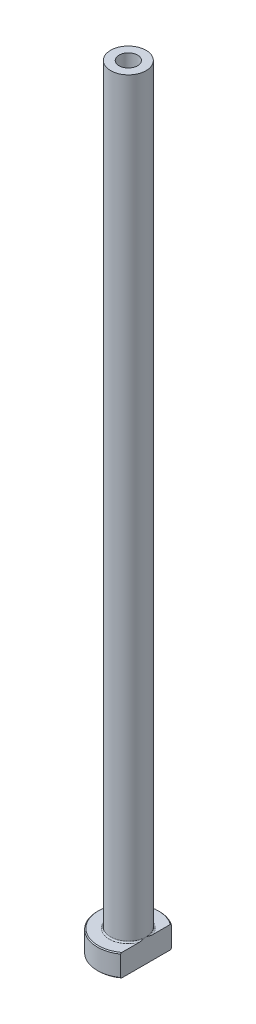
ISO-10303-21;
HEADER;
FILE_DESCRIPTION(('STEP AP214'),'2;1');
FILE_NAME('part.step','',(''),(''),'','','');
FILE_SCHEMA(('AUTOMOTIVE_DESIGN { 1 0 10303 214 1 1 1 1 }'));
ENDSEC;
DATA;
#1=APPLICATION_CONTEXT('core data for automotive mechanical design processes');
#2=APPLICATION_PROTOCOL_DEFINITION('international standard','automotive_design',2000,#1);
#3=PRODUCT_CONTEXT('',#1,'mechanical');
#4=PRODUCT('Part','Part','',(#3));
#5=PRODUCT_RELATED_PRODUCT_CATEGORY('part','',(#4));
#6=PRODUCT_DEFINITION_FORMATION('','',#4);
#7=PRODUCT_DEFINITION_CONTEXT('part definition',#1,'design');
#8=PRODUCT_DEFINITION('design','',#6,#7);
#9=PRODUCT_DEFINITION_SHAPE('','',#8);
#10=(LENGTH_UNIT() NAMED_UNIT(*) SI_UNIT(.MILLI.,.METRE.));
#11=(NAMED_UNIT(*) PLANE_ANGLE_UNIT() SI_UNIT($,.RADIAN.));
#12=(NAMED_UNIT(*) SI_UNIT($,.STERADIAN.) SOLID_ANGLE_UNIT());
#13=UNCERTAINTY_MEASURE_WITH_UNIT(LENGTH_MEASURE(1.E-05),#10,'distance_accuracy_value','');
#14=(GEOMETRIC_REPRESENTATION_CONTEXT(3) GLOBAL_UNCERTAINTY_ASSIGNED_CONTEXT((#13)) GLOBAL_UNIT_ASSIGNED_CONTEXT((#10,
#11,#12)) REPRESENTATION_CONTEXT('',''));
#15=CARTESIAN_POINT('',(0.,0.,0.));
#16=DIRECTION('',(0.,0.,1.));
#17=DIRECTION('',(1.,0.,0.));
#18=AXIS2_PLACEMENT_3D('',#15,#16,#17);
#19=CARTESIAN_POINT('',(0.,92.1876809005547,0.));
#20=DIRECTION('',(0.,1.,0.));
#21=DIRECTION('',(0.,0.,1.));
#22=AXIS2_PLACEMENT_3D('',#19,#20,#21);
#23=CYLINDRICAL_SURFACE('',#22,2.1);
#24=CARTESIAN_POINT('',(0.,175.,0.));
#25=DIRECTION('',(0.,1.,0.));
#26=DIRECTION('',(0.,0.,1.));
#27=AXIS2_PLACEMENT_3D('',#24,#25,#26);
#28=CIRCLE('',#27,2.1);
#29=CARTESIAN_POINT('',(0.,175.,2.1));
#30=VERTEX_POINT('',#29);
#31=EDGE_CURVE('E167',#30,#30,#28,.T.);
#32=ORIENTED_EDGE('',*,*,#31,.T.);
#33=EDGE_LOOP('',(#32));
#34=FACE_BOUND('',#33,.T.);
#35=CARTESIAN_POINT('',(0.,130.,0.));
#36=DIRECTION('',(0.,1.,0.));
#37=DIRECTION('',(0.,0.,1.));
#38=AXIS2_PLACEMENT_3D('',#35,#36,#37);
#39=CIRCLE('',#38,2.1);
#40=CARTESIAN_POINT('',(0.,130.,2.1));
#41=VERTEX_POINT('',#40);
#42=EDGE_CURVE('E170',#41,#41,#39,.T.);
#43=ORIENTED_EDGE('',*,*,#42,.F.);
#44=EDGE_LOOP('',(#43));
#45=FACE_BOUND('',#44,.T.);
#46=ADVANCED_FACE('F32',(#34,#45),#23,.F.);
#47=CARTESIAN_POINT('',(-2.1,175.,0.));
#48=DIRECTION('',(0.,1.,0.));
#49=DIRECTION('',(0.,0.,1.));
#50=AXIS2_PLACEMENT_3D('',#47,#48,#49);
#51=PLANE('',#50);
#52=CARTESIAN_POINT('',(0.,175.,0.));
#53=DIRECTION('',(0.,1.,0.));
#54=DIRECTION('',(0.,0.,1.));
#55=AXIS2_PLACEMENT_3D('',#52,#53,#54);
#56=CIRCLE('',#55,4.00000000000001);
#57=CARTESIAN_POINT('',(0.,175.,4.00000000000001));
#58=VERTEX_POINT('',#57);
#59=EDGE_CURVE('E174',#58,#58,#56,.T.);
#60=ORIENTED_EDGE('',*,*,#59,.T.);
#61=EDGE_LOOP('',(#60));
#62=FACE_BOUND('',#61,.T.);
#63=ORIENTED_EDGE('',*,*,#31,.F.);
#64=EDGE_LOOP('',(#63));
#65=FACE_BOUND('',#64,.T.);
#66=ADVANCED_FACE('F157',(#62,#65),#51,.T.);
#67=CARTESIAN_POINT('',(0.,92.1876809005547,0.));
#68=DIRECTION('',(0.,1.,0.));
#69=DIRECTION('',(0.,0.,1.));
#70=AXIS2_PLACEMENT_3D('',#67,#68,#69);
#71=CYLINDRICAL_SURFACE('',#70,4.);
#72=CARTESIAN_POINT('',(0.,5.3,0.));
#73=DIRECTION('',(0.,1.,0.));
#74=DIRECTION('',(0.,0.,1.));
#75=AXIS2_PLACEMENT_3D('',#72,#73,#74);
#76=CIRCLE('',#75,4.);
#77=CARTESIAN_POINT('',(4.,5.3,0.));
#78=VERTEX_POINT('',#77);
#79=EDGE_CURVE('E180',#78,#78,#76,.T.);
#80=ORIENTED_EDGE('',*,*,#79,.T.);
#81=EDGE_LOOP('',(#80));
#82=FACE_BOUND('',#81,.T.);
#83=ORIENTED_EDGE('',*,*,#59,.F.);
#84=EDGE_LOOP('',(#83));
#85=FACE_BOUND('',#84,.T.);
#86=ADVANCED_FACE('F162',(#82,#85),#71,.T.);
#87=CARTESIAN_POINT('',(-3.99999999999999,5.,0.));
#88=DIRECTION('',(0.,1.,0.));
#89=DIRECTION('',(0.,0.,1.));
#90=AXIS2_PLACEMENT_3D('',#87,#88,#89);
#91=PLANE('',#90);
#92=DIRECTION('',(0.,0.,1.));
#93=VECTOR('',#92,1.);
#94=CARTESIAN_POINT('',(4.,5.,0.));
#95=LINE('',#94,#93);
#96=CARTESIAN_POINT('',(4.,5.,-5.499090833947));
#97=VERTEX_POINT('',#96);
#98=CARTESIAN_POINT('',(4.,5.,-1.57797338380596));
#99=VERTEX_POINT('',#98);
#100=EDGE_CURVE('E54',#97,#99,#95,.T.);
#101=ORIENTED_EDGE('',*,*,#100,.F.);
#102=CARTESIAN_POINT('',(0.,5.,0.));
#103=DIRECTION('',(0.,1.,0.));
#104=DIRECTION('',(0.,0.,1.));
#105=AXIS2_PLACEMENT_3D('',#102,#103,#104);
#106=CIRCLE('',#105,6.79999999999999);
#107=CARTESIAN_POINT('',(3.99999999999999,5.,5.499090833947));
#108=VERTEX_POINT('',#107);
#109=EDGE_CURVE('E186',#97,#108,#106,.T.);
#110=ORIENTED_EDGE('',*,*,#109,.T.);
#111=CARTESIAN_POINT('',(4.,5.,1.57797338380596));
#112=VERTEX_POINT('',#111);
#113=EDGE_CURVE('E134',#112,#108,#95,.T.);
#114=ORIENTED_EDGE('',*,*,#113,.F.);
#115=CARTESIAN_POINT('',(0.,5.,0.));
#116=DIRECTION('',(0.,1.,0.));
#117=DIRECTION('',(0.,0.,1.));
#118=AXIS2_PLACEMENT_3D('',#115,#116,#117);
#119=CIRCLE('',#118,4.3);
#120=EDGE_CURVE('E183',#112,#99,#119,.F.);
#121=ORIENTED_EDGE('',*,*,#120,.T.);
#122=EDGE_LOOP('',(#101,#110,#114,#121));
#123=FACE_BOUND('',#122,.T.);
#124=ADVANCED_FACE('F197',(#123),#91,.T.);
#125=CARTESIAN_POINT('',(0.,92.1876809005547,0.));
#126=DIRECTION('',(0.,1.,0.));
#127=DIRECTION('',(0.,0.,1.));
#128=AXIS2_PLACEMENT_3D('',#125,#126,#127);
#129=CYLINDRICAL_SURFACE('',#128,6.99999999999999);
#130=DIRECTION('',(0.,-1.,0.));
#131=VECTOR('',#130,1.);
#132=CARTESIAN_POINT('',(3.99999999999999,175.,5.74456264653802));
#133=LINE('',#132,#131);
#134=CARTESIAN_POINT('',(3.99999999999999,4.79999999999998,5.74456264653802));
#135=VERTEX_POINT('',#134);
#136=CARTESIAN_POINT('',(3.99999999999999,0.20000000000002,5.74456264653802));
#137=VERTEX_POINT('',#136);
#138=EDGE_CURVE('E82',#135,#137,#133,.T.);
#139=ORIENTED_EDGE('',*,*,#138,.F.);
#140=CARTESIAN_POINT('',(0.,4.79999999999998,0.));
#141=DIRECTION('',(0.,1.,0.));
#142=DIRECTION('',(0.,0.,1.));
#143=AXIS2_PLACEMENT_3D('',#140,#141,#142);
#144=CIRCLE('',#143,6.99999999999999);
#145=CARTESIAN_POINT('',(4.,4.79999999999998,-5.74456264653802));
#146=VERTEX_POINT('',#145);
#147=EDGE_CURVE('E95',#135,#146,#144,.F.);
#148=ORIENTED_EDGE('',*,*,#147,.T.);
#149=DIRECTION('',(0.,-1.,0.));
#150=VECTOR('',#149,1.);
#151=CARTESIAN_POINT('',(4.,175.,-5.74456264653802));
#152=LINE('',#151,#150);
#153=CARTESIAN_POINT('',(4.,0.200000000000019,-5.74456264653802));
#154=VERTEX_POINT('',#153);
#155=EDGE_CURVE('E192',#146,#154,#152,.T.);
#156=ORIENTED_EDGE('',*,*,#155,.T.);
#157=CARTESIAN_POINT('',(0.,0.20000000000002,0.));
#158=DIRECTION('',(0.,-1.,0.));
#159=DIRECTION('',(0.,0.,-1.));
#160=AXIS2_PLACEMENT_3D('',#157,#158,#159);
#161=CIRCLE('',#160,6.99999999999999);
#162=EDGE_CURVE('E98',#154,#137,#161,.F.);
#163=ORIENTED_EDGE('',*,*,#162,.T.);
#164=EDGE_LOOP('',(#139,#148,#156,#163));
#165=FACE_BOUND('',#164,.T.);
#166=ADVANCED_FACE('F190',(#165),#129,.T.);
#167=CARTESIAN_POINT('',(-6.99999999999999,0.,0.));
#168=DIRECTION('',(0.,-1.,0.));
#169=DIRECTION('',(0.,0.,-1.));
#170=AXIS2_PLACEMENT_3D('',#167,#168,#169);
#171=PLANE('',#170);
#172=CARTESIAN_POINT('',(0.,0.,0.));
#173=DIRECTION('',(0.,-1.,0.));
#174=DIRECTION('',(0.,0.,-1.));
#175=AXIS2_PLACEMENT_3D('',#172,#173,#174);
#176=CIRCLE('',#175,2.84999999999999);
#177=CARTESIAN_POINT('',(0.,0.,-2.84999999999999));
#178=VERTEX_POINT('',#177);
#179=EDGE_CURVE('E40',#178,#178,#176,.F.);
#180=ORIENTED_EDGE('',*,*,#179,.T.);
#181=EDGE_LOOP('',(#180));
#182=FACE_BOUND('',#181,.T.);
#183=DIRECTION('',(0.,0.,-1.));
#184=VECTOR('',#183,1.);
#185=CARTESIAN_POINT('',(3.99999999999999,0.,5.74456264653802));
#186=LINE('',#185,#184);
#187=CARTESIAN_POINT('',(3.99999999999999,0.,5.49909083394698));
#188=VERTEX_POINT('',#187);
#189=CARTESIAN_POINT('',(4.,0.,-5.49909083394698));
#190=VERTEX_POINT('',#189);
#191=EDGE_CURVE('E47',#188,#190,#186,.T.);
#192=ORIENTED_EDGE('',*,*,#191,.F.);
#193=CARTESIAN_POINT('',(0.,0.,0.));
#194=DIRECTION('',(0.,-1.,0.));
#195=DIRECTION('',(0.,0.,-1.));
#196=AXIS2_PLACEMENT_3D('',#193,#194,#195);
#197=CIRCLE('',#196,6.79999999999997);
#198=EDGE_CURVE('E92',#188,#190,#197,.T.);
#199=ORIENTED_EDGE('',*,*,#198,.T.);
#200=EDGE_LOOP('',(#192,#199));
#201=FACE_BOUND('',#200,.T.);
#202=ADVANCED_FACE('F91',(#182,#201),#171,.T.);
#203=CARTESIAN_POINT('',(0.,92.1876809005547,0.));
#204=DIRECTION('',(0.,1.,0.));
#205=DIRECTION('',(0.,0.,1.));
#206=AXIS2_PLACEMENT_3D('',#203,#204,#205);
#207=CYLINDRICAL_SURFACE('',#206,2.35);
#208=CARTESIAN_POINT('',(0.,0.499999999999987,0.));
#209=DIRECTION('',(0.,-1.,0.));
#210=DIRECTION('',(0.,0.,-1.));
#211=AXIS2_PLACEMENT_3D('',#208,#209,#210);
#212=CIRCLE('',#211,2.35);
#213=CARTESIAN_POINT('',(0.,0.499999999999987,-2.35));
#214=VERTEX_POINT('',#213);
#215=EDGE_CURVE('E11',#214,#214,#212,.T.);
#216=ORIENTED_EDGE('',*,*,#215,.T.);
#217=EDGE_LOOP('',(#216));
#218=FACE_BOUND('',#217,.T.);
#219=CARTESIAN_POINT('',(0.,118.,0.));
#220=DIRECTION('',(0.,1.,0.));
#221=DIRECTION('',(0.,0.,1.));
#222=AXIS2_PLACEMENT_3D('',#219,#220,#221);
#223=CIRCLE('',#222,2.35000000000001);
#224=CARTESIAN_POINT('',(0.,118.,2.35000000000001));
#225=VERTEX_POINT('',#224);
#226=EDGE_CURVE('E172',#225,#225,#223,.T.);
#227=ORIENTED_EDGE('',*,*,#226,.T.);
#228=EDGE_LOOP('',(#227));
#229=FACE_BOUND('',#228,.T.);
#230=ADVANCED_FACE('F215',(#218,#229),#207,.F.);
#231=CARTESIAN_POINT('',(0.,118.,0.));
#232=DIRECTION('',(0.,-1.,0.));
#233=DIRECTION('',(0.,0.,-1.));
#234=AXIS2_PLACEMENT_3D('',#231,#232,#233);
#235=CONICAL_SURFACE('',#234,2.35000000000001,0.0208303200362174);
#236=ORIENTED_EDGE('',*,*,#42,.T.);
#237=EDGE_LOOP('',(#236));
#238=FACE_BOUND('',#237,.T.);
#239=ORIENTED_EDGE('',*,*,#226,.F.);
#240=EDGE_LOOP('',(#239));
#241=FACE_BOUND('',#240,.T.);
#242=ADVANCED_FACE('F111',(#238,#241),#235,.F.);
#243=CARTESIAN_POINT('',(0.,5.3,0.));
#244=DIRECTION('',(0.,1.,0.));
#245=DIRECTION('',(0.,0.,1.));
#246=AXIS2_PLACEMENT_3D('',#243,#244,#245);
#247=TOROIDAL_SURFACE('',#246,4.3,0.3);
#248=ORIENTED_EDGE('',*,*,#120,.F.);
#249=CARTESIAN_POINT('',(4.,5.3,0.));
#250=CARTESIAN_POINT('',(4.,5.30000062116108,-1.06261529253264E-10));
#251=CARTESIAN_POINT('',(4.,5.30000124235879,2.17726073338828E-07));
#252=CARTESIAN_POINT('',(4.,5.30000240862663,8.36141018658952E-07));
#253=CARTESIAN_POINT('',(4.,5.30000294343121,1.2501168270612E-06));
#254=CARTESIAN_POINT('',(4.,5.30000404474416,2.23959340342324E-06));
#255=CARTESIAN_POINT('',(4.,5.30000459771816,2.83084465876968E-06));
#256=CARTESIAN_POINT('',(4.,5.30000559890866,4.0651660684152E-06));
#257=CARTESIAN_POINT('',(4.,5.30000604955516,4.70640086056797E-06));
#258=CARTESIAN_POINT('',(4.,5.3000076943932,7.15677214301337E-06));
#259=CARTESIAN_POINT('',(4.,5.3000087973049,9.02995984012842E-06));
#260=CARTESIAN_POINT('',(4.,5.30001063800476,1.27664888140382E-05));
#261=CARTESIAN_POINT('',(4.,5.30001139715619,1.46197807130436E-05));
#262=CARTESIAN_POINT('',(4.,5.30001453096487,2.23679224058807E-05));
#263=CARTESIAN_POINT('',(4.,5.30001683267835,2.82968752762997E-05));
#264=CARTESIAN_POINT('',(4.,5.30002027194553,3.95668733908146E-05));
#265=CARTESIAN_POINT('',(4.,5.30002152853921,4.48715464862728E-05));
#266=CARTESIAN_POINT('',(4.,5.30003060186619,8.40118205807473E-05));
#267=CARTESIAN_POINT('',(4.,5.30003739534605,0.000118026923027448));
#268=CARTESIAN_POINT('',(4.,5.30006713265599,0.00025221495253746));
#269=CARTESIAN_POINT('',(4.,5.30009559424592,0.00035113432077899));
#270=CARTESIAN_POINT('',(3.99999999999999,5.30020622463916,0.000742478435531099));
#271=CARTESIAN_POINT('',(4.,5.30028475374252,0.00103561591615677));
#272=CARTESIAN_POINT('',(4.,5.30059889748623,0.00219920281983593));
#273=CARTESIAN_POINT('',(4.,5.3008390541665,0.00306873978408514));
#274=CARTESIAN_POINT('',(3.99999999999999,5.30183682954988,0.00669141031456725));
#275=CARTESIAN_POINT('',(4.,5.30258877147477,0.00944568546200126));
#276=CARTESIAN_POINT('',(4.,5.31066890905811,0.0390293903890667));
#277=CARTESIAN_POINT('',(4.,5.31802631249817,0.0658531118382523));
#278=CARTESIAN_POINT('',(3.99999999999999,5.3323967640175,0.118441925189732));
#279=CARTESIAN_POINT('',(4.,5.33941183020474,0.144206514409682));
#280=CARTESIAN_POINT('',(4.,5.35427366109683,0.199017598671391));
#281=CARTESIAN_POINT('',(4.,5.36211313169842,0.228066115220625));
#282=CARTESIAN_POINT('',(4.,5.3777634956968,0.28651184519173));
#283=CARTESIAN_POINT('',(4.,5.38557313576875,0.315909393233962));
#284=CARTESIAN_POINT('',(4.,5.40425662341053,0.386994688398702));
#285=CARTESIAN_POINT('',(4.,5.41505237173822,0.428703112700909));
#286=CARTESIAN_POINT('',(4.,5.43592310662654,0.511098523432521));
#287=CARTESIAN_POINT('',(4.,5.44600969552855,0.551782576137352));
#288=CARTESIAN_POINT('',(4.,5.47850986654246,0.686599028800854));
#289=CARTESIAN_POINT('',(4.,5.4997837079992,0.781011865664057));
#290=CARTESIAN_POINT('',(4.,5.53807543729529,0.971847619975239));
#291=CARTESIAN_POINT('',(4.,5.5550427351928,1.06828120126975));
#292=CARTESIAN_POINT('',(4.,5.5758240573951,1.21752725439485));
#293=CARTESIAN_POINT('',(4.,5.5820979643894,1.26999379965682));
#294=CARTESIAN_POINT('',(4.,5.59210686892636,1.37516324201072));
#295=CARTESIAN_POINT('',(4.,5.59584265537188,1.42786606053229));
#296=CARTESIAN_POINT('',(4.,5.60010438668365,1.53310673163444));
#297=CARTESIAN_POINT('',(4.,5.6006487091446,1.58564378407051));
#298=CARTESIAN_POINT('',(4.,5.59767158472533,1.69058605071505));
#299=CARTESIAN_POINT('',(4.,5.59415502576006,1.74299134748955));
#300=CARTESIAN_POINT('',(4.,5.58503062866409,1.81903290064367));
#301=CARTESIAN_POINT('',(4.,5.58157617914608,1.84292934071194));
#302=CARTESIAN_POINT('',(4.,5.57329952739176,1.89051061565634));
#303=CARTESIAN_POINT('',(4.,5.56847619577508,1.91419525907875));
#304=CARTESIAN_POINT('',(4.,5.5572664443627,1.96092888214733));
#305=CARTESIAN_POINT('',(4.,5.55089740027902,1.98398195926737));
#306=CARTESIAN_POINT('',(4.,5.53623434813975,2.02945550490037));
#307=CARTESIAN_POINT('',(4.,5.52794253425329,2.05187666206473));
#308=CARTESIAN_POINT('',(4.,5.50887098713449,2.09590631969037));
#309=CARTESIAN_POINT('',(4.,5.49806837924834,2.1175050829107));
#310=CARTESIAN_POINT('',(4.,5.4733340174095,2.15885583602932));
#311=CARTESIAN_POINT('',(4.,5.45941272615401,2.17861369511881));
#312=CARTESIAN_POINT('',(4.,5.43588221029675,2.20522942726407));
#313=CARTESIAN_POINT('',(4.,5.42781139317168,2.21344043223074));
#314=CARTESIAN_POINT('',(4.,5.4106511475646,2.22875149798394));
#315=CARTESIAN_POINT('',(4.,5.40156129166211,2.23585108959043));
#316=CARTESIAN_POINT('',(4.,5.38220524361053,2.24859694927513));
#317=CARTESIAN_POINT('',(4.,5.37192420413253,2.25422119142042));
#318=CARTESIAN_POINT('',(4.,5.35045072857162,2.26331064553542));
#319=CARTESIAN_POINT('',(4.,5.3392612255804,2.26678251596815));
#320=CARTESIAN_POINT('',(4.,5.31952044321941,2.27051268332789));
#321=CARTESIAN_POINT('',(4.,5.31108453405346,2.27139016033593));
#322=CARTESIAN_POINT('',(4.,5.29418624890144,2.27168963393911));
#323=CARTESIAN_POINT('',(4.,5.28572387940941,2.27111196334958));
#324=CARTESIAN_POINT('',(4.,5.26904138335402,2.26855580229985));
#325=CARTESIAN_POINT('',(4.,5.2608206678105,2.26658107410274));
#326=CARTESIAN_POINT('',(4.,5.2447821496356,2.26139496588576));
#327=CARTESIAN_POINT('',(4.,5.2369646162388,2.25818277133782));
#328=CARTESIAN_POINT('',(4.,5.21851235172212,2.24908332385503));
#329=CARTESIAN_POINT('',(4.,5.20815219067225,2.24264095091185));
#330=CARTESIAN_POINT('',(4.,5.1885797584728,2.22819957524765));
#331=CARTESIAN_POINT('',(4.,5.17937061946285,2.22019647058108));
#332=CARTESIAN_POINT('',(4.,5.1566538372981,2.19777756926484));
#333=CARTESIAN_POINT('',(4.,5.14403484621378,2.18246908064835));
#334=CARTESIAN_POINT('',(4.,5.12118369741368,2.15020843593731));
#335=CARTESIAN_POINT('',(4.,5.1109548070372,2.13325407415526));
#336=CARTESIAN_POINT('',(4.,5.09273574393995,2.09892324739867));
#337=CARTESIAN_POINT('',(4.,5.08468212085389,2.08157988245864));
#338=CARTESIAN_POINT('',(4.,5.07005901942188,2.04627072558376));
#339=CARTESIAN_POINT('',(4.,5.06349101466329,2.02830433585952));
#340=CARTESIAN_POINT('',(4.,5.04555485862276,1.97350761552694));
#341=CARTESIAN_POINT('',(4.,5.03608974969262,1.93605770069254));
#342=CARTESIAN_POINT('',(4.,5.01780569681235,1.84529235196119));
#343=CARTESIAN_POINT('',(4.,5.01077018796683,1.79164082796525));
#344=CARTESIAN_POINT('',(4.,5.00182846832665,1.68379947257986));
#345=CARTESIAN_POINT('',(4.,4.99993887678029,1.62960846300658));
#346=CARTESIAN_POINT('',(4.,5.0000612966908,1.52361204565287));
#347=CARTESIAN_POINT('',(4.,5.00190698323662,1.47180551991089));
#348=CARTESIAN_POINT('',(4.,5.00841243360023,1.36835357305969));
#349=CARTESIAN_POINT('',(4.,5.01307376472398,1.31670825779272));
#350=CARTESIAN_POINT('',(4.,5.02905484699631,1.17431887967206));
#351=CARTESIAN_POINT('',(4.,5.04274090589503,1.08384207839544));
#352=CARTESIAN_POINT('',(4.,5.06701714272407,0.947757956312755));
#353=CARTESIAN_POINT('',(4.,5.07585573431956,0.901814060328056));
#354=CARTESIAN_POINT('',(4.,5.09458665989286,0.810008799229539));
#355=CARTESIAN_POINT('',(4.,5.10448180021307,0.764148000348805));
#356=CARTESIAN_POINT('',(4.,5.12892434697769,0.655631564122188));
#357=CARTESIAN_POINT('',(3.99999999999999,5.14383556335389,0.593058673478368));
#358=CARTESIAN_POINT('',(4.,5.17458762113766,0.468885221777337));
#359=CARTESIAN_POINT('',(4.,5.19041623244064,0.407281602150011));
#360=CARTESIAN_POINT('',(3.99999999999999,5.22090834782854,0.291232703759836));
#361=CARTESIAN_POINT('',(3.99999999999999,5.23550024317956,0.2367683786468));
#362=CARTESIAN_POINT('',(4.00000000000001,5.26562550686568,0.125604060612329));
#363=CARTESIAN_POINT('',(4.00000000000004,5.28117250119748,0.0689076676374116));
#364=CARTESIAN_POINT('',(3.99999999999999,5.29741226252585,0.00944154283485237));
#365=CARTESIAN_POINT('',(3.99999999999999,5.29816540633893,0.00668315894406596));
#366=CARTESIAN_POINT('',(4.,5.29916346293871,0.00305954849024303));
#367=CARTESIAN_POINT('',(4.,5.29940273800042,0.00219318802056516));
#368=CARTESIAN_POINT('',(3.99999999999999,5.29971580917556,0.00103357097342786));
#369=CARTESIAN_POINT('',(3.99999999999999,5.29979412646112,0.000741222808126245));
#370=CARTESIAN_POINT('',(4.,5.29990450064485,0.00035080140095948));
#371=CARTESIAN_POINT('',(4.,5.29993292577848,0.000252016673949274));
#372=CARTESIAN_POINT('',(3.99999999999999,5.29996263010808,0.000117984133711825));
#373=CARTESIAN_POINT('',(3.99999999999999,5.29996941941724,8.39881898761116E-05));
#374=CARTESIAN_POINT('',(4.,5.29997848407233,4.48674015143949E-05));
#375=CARTESIAN_POINT('',(4.,5.29997973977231,3.95638189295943E-05));
#376=CARTESIAN_POINT('',(4.,5.29998317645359,2.8296033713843E-05));
#377=CARTESIAN_POINT('',(4.,5.29998547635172,2.23681454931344E-05));
#378=CARTESIAN_POINT('',(4.,5.29998860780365,1.46211000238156E-05));
#379=CARTESIAN_POINT('',(4.,5.29998936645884,1.2767889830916E-05));
#380=CARTESIAN_POINT('',(4.,5.29999120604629,9.03144036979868E-06));
#381=CARTESIAN_POINT('',(4.,5.29999230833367,7.15824074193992E-06));
#382=CARTESIAN_POINT('',(4.,5.29999395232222,4.70775514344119E-06));
#383=CARTESIAN_POINT('',(4.,5.29999440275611,4.06646377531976E-06));
#384=CARTESIAN_POINT('',(4.,5.29999540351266,2.83199084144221E-06));
#385=CARTESIAN_POINT('',(4.,5.29999595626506,2.24064341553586E-06));
#386=CARTESIAN_POINT('',(4.,5.2999970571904,1.25093972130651E-06));
#387=CARTESIAN_POINT('',(4.,5.29999759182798,8.36841075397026E-07));
#388=CARTESIAN_POINT('',(4.,5.29999875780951,2.18117755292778E-07));
#389=CARTESIAN_POINT('',(4.,5.29999937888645,1.06254606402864E-10));
#390=CARTESIAN_POINT('',(4.,5.3,0.));
#391=B_SPLINE_CURVE_WITH_KNOTS('',3,(#249,#250,#251,#252,#253,#254,#255,#256,#257,#258,#259,
#260,#261,#262,#263,#264,#265,#266,#267,#268,#269,#270,#271,#272,#273,#274,#275,#276,#277,#278,
#279,#280,#281,#282,#283,#284,#285,#286,#287,#288,#289,#290,#291,#292,#293,#294,#295,#296,#297,
#298,#299,#300,#301,#302,#303,#304,#305,#306,#307,#308,#309,#310,#311,#312,#313,#314,#315,#316,
#317,#318,#319,#320,#321,#322,#323,#324,#325,#326,#327,#328,#329,#330,#331,#332,#333,#334,#335,
#336,#337,#338,#339,#340,#341,#342,#343,#344,#345,#346,#347,#348,#349,#350,#351,#352,#353,#354,
#355,#356,#357,#358,#359,#360,#361,#362,#363,#364,#365,#366,#367,#368,#369,#370,#371,#372,#373,
#374,#375,#376,#377,#378,#379,#380,#381,#382,#383,#384,#385,#386,#387,#388,#389,#390),
.UNSPECIFIED.,.T.,.F.,(4,2,2,2,2,2,2,2,2,2,2,2,2,2,2,2,2,2,2,2,2,2,2,2,2,2,2,2,2,2,2,2,2,2,2,2,
2,2,2,2,2,2,2,2,2,2,2,2,2,2,2,2,2,2,2,2,2,2,2,2,2,2,2,2,2,2,2,2,2,2,4),(0.,1.87484430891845E-06,
3.90180055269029E-06,6.31683886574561E-06,8.66652039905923E-06,1.51627563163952E-05,
2.1165794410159E-05,4.020907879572E-05,5.65429486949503E-05,0.000160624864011,
0.000469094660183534,0.00137985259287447,0.00408571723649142,0.0126514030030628,
0.0960918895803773,0.176200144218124,0.266463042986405,0.357714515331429,0.486961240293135,
0.61270708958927,0.902988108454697,1.196535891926,1.35501075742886,1.51343634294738,
1.67094875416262,1.82827177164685,1.90067591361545,1.97313996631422,2.04482437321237,
2.11642737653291,2.18871023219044,2.26075412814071,2.29521947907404,2.32969934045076,
2.36466792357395,2.39952778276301,2.42485422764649,2.45017488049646,2.47542760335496,
2.50069697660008,2.53708899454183,2.57357798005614,2.63276032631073,2.69202310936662,
2.74930315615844,2.80663977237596,2.92223125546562,3.08420752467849,3.24670629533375,
3.40212850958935,3.55763731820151,3.83192962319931,3.97228382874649,4.11302057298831,
4.30598130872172,4.49678885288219,4.66594443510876,4.84230602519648,4.85088453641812,
4.85358051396,4.8544888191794,4.85479687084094,4.8549008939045,4.8549172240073,4.85493626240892,
4.85494226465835,4.85494875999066,4.85495110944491,4.85495352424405,4.85495555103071,
4.85495742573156),.UNSPECIFIED.);
#392=EDGE_CURVE('E126',#112,#78,#391,.T.);
#393=ORIENTED_EDGE('',*,*,#392,.T.);
#394=ORIENTED_EDGE('',*,*,#79,.F.);
#395=CARTESIAN_POINT('',(4.,5.3,0.));
#396=CARTESIAN_POINT('',(4.,5.29999937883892,1.06262853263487E-10));
#397=CARTESIAN_POINT('',(4.,5.29999875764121,-2.17726072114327E-07));
#398=CARTESIAN_POINT('',(4.,5.29999759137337,-8.36141017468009E-07));
#399=CARTESIAN_POINT('',(4.,5.29999705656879,-1.25011682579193E-06));
#400=CARTESIAN_POINT('',(4.,5.29999595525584,-2.23959340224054E-06));
#401=CARTESIAN_POINT('',(4.,5.29999540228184,-2.83084465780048E-06));
#402=CARTESIAN_POINT('',(4.,5.29999440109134,-4.06516606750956E-06));
#403=CARTESIAN_POINT('',(4.,5.29999395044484,-4.70640085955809E-06));
#404=CARTESIAN_POINT('',(4.,5.2999923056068,-7.15677214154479E-06));
#405=CARTESIAN_POINT('',(4.,5.2999912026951,-9.02995983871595E-06));
#406=CARTESIAN_POINT('',(4.,5.29998936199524,-1.27664888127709E-05));
#407=CARTESIAN_POINT('',(4.,5.29998860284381,-1.46197807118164E-05));
#408=CARTESIAN_POINT('',(4.,5.29998546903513,-2.2367922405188E-05));
#409=CARTESIAN_POINT('',(4.,5.29998316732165,-2.82968752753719E-05));
#410=CARTESIAN_POINT('',(4.,5.29997972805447,-3.95668733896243E-05));
#411=CARTESIAN_POINT('',(4.,5.29997847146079,-4.48715464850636E-05));
#412=CARTESIAN_POINT('',(4.,5.29996939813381,-8.40118205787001E-05));
#413=CARTESIAN_POINT('',(4.,5.29996260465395,-0.000118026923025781));
#414=CARTESIAN_POINT('',(4.,5.29993286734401,-0.000252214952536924));
#415=CARTESIAN_POINT('',(4.,5.29990440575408,-0.000351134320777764));
#416=CARTESIAN_POINT('',(3.99999999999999,5.29979377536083,-0.000742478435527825));
#417=CARTESIAN_POINT('',(4.,5.29971524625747,-0.00103561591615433));
#418=CARTESIAN_POINT('',(4.,5.29940110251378,-0.00219920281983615));
#419=CARTESIAN_POINT('',(4.,5.2991609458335,-0.00306873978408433));
#420=CARTESIAN_POINT('',(3.99999999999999,5.29816317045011,-0.00669141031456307));
#421=CARTESIAN_POINT('',(4.,5.29741122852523,-0.00944568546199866));
#422=CARTESIAN_POINT('',(4.,5.28933109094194,-0.0390293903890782));
#423=CARTESIAN_POINT('',(4.,5.28197368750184,-0.0658531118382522));
#424=CARTESIAN_POINT('',(3.99999999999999,5.26760323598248,-0.118441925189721));
#425=CARTESIAN_POINT('',(4.,5.26058816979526,-0.144206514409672));
#426=CARTESIAN_POINT('',(4.,5.24572633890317,-0.199017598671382));
#427=CARTESIAN_POINT('',(4.,5.23788686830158,-0.228066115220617));
#428=CARTESIAN_POINT('',(4.,5.2222365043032,-0.286511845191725));
#429=CARTESIAN_POINT('',(4.,5.21442686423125,-0.315909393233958));
#430=CARTESIAN_POINT('',(4.,5.19574337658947,-0.386994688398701));
#431=CARTESIAN_POINT('',(4.,5.18494762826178,-0.428703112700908));
#432=CARTESIAN_POINT('',(4.,5.16407689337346,-0.511098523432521));
#433=CARTESIAN_POINT('',(4.,5.15399030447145,-0.551782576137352));
#434=CARTESIAN_POINT('',(4.,5.12149013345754,-0.686599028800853));
#435=CARTESIAN_POINT('',(4.,5.1002162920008,-0.781011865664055));
#436=CARTESIAN_POINT('',(4.,5.06192456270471,-0.971847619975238));
#437=CARTESIAN_POINT('',(4.,5.0449572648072,-1.06828120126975));
#438=CARTESIAN_POINT('',(4.,5.02417594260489,-1.21752725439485));
#439=CARTESIAN_POINT('',(4.,5.01790203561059,-1.26999379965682));
#440=CARTESIAN_POINT('',(4.,5.00789313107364,-1.37516324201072));
#441=CARTESIAN_POINT('',(4.,5.00415734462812,-1.42786606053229));
#442=CARTESIAN_POINT('',(4.,4.99989561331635,-1.53310673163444));
#443=CARTESIAN_POINT('',(4.,4.9993512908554,-1.58564378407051));
#444=CARTESIAN_POINT('',(4.,5.00232841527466,-1.69058605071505));
#445=CARTESIAN_POINT('',(4.,5.00584497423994,-1.74299134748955));
#446=CARTESIAN_POINT('',(4.,5.0149693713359,-1.81903290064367));
#447=CARTESIAN_POINT('',(4.,5.01842382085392,-1.84292934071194));
#448=CARTESIAN_POINT('',(4.,5.02670047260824,-1.89051061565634));
#449=CARTESIAN_POINT('',(4.,5.03152380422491,-1.91419525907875));
#450=CARTESIAN_POINT('',(4.,5.0427335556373,-1.96092888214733));
#451=CARTESIAN_POINT('',(4.,5.04910259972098,-1.98398195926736));
#452=CARTESIAN_POINT('',(4.,5.06376565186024,-2.02945550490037));
#453=CARTESIAN_POINT('',(4.,5.07205746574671,-2.05187666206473));
#454=CARTESIAN_POINT('',(4.,5.09112901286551,-2.09590631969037));
#455=CARTESIAN_POINT('',(4.,5.10193162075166,-2.1175050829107));
#456=CARTESIAN_POINT('',(4.,5.1266659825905,-2.15885583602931));
#457=CARTESIAN_POINT('',(4.,5.14058727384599,-2.17861369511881));
#458=CARTESIAN_POINT('',(4.,5.16411778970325,-2.20522942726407));
#459=CARTESIAN_POINT('',(4.,5.17218860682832,-2.21344043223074));
#460=CARTESIAN_POINT('',(4.,5.1893488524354,-2.22875149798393));
#461=CARTESIAN_POINT('',(4.,5.19843870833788,-2.23585108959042));
#462=CARTESIAN_POINT('',(4.,5.21779475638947,-2.24859694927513));
#463=CARTESIAN_POINT('',(4.,5.22807579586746,-2.25422119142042));
#464=CARTESIAN_POINT('',(4.,5.24954927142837,-2.26331064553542));
#465=CARTESIAN_POINT('',(4.,5.2607387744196,-2.26678251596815));
#466=CARTESIAN_POINT('',(4.,5.28047955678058,-2.27051268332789));
#467=CARTESIAN_POINT('',(4.,5.28891546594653,-2.27139016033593));
#468=CARTESIAN_POINT('',(4.,5.30581375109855,-2.27168963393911));
#469=CARTESIAN_POINT('',(4.,5.31427612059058,-2.27111196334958));
#470=CARTESIAN_POINT('',(4.,5.33095861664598,-2.26855580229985));
#471=CARTESIAN_POINT('',(4.,5.3391793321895,-2.26658107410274));
#472=CARTESIAN_POINT('',(4.,5.35521785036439,-2.26139496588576));
#473=CARTESIAN_POINT('',(4.,5.3630353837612,-2.25818277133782));
#474=CARTESIAN_POINT('',(4.,5.38148764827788,-2.24908332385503));
#475=CARTESIAN_POINT('',(4.,5.39184780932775,-2.24264095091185));
#476=CARTESIAN_POINT('',(4.,5.4114202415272,-2.22819957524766));
#477=CARTESIAN_POINT('',(4.,5.42062938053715,-2.22019647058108));
#478=CARTESIAN_POINT('',(4.,5.44334616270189,-2.19777756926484));
#479=CARTESIAN_POINT('',(4.,5.45596515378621,-2.18246908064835));
#480=CARTESIAN_POINT('',(4.,5.47881630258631,-2.15020843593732));
#481=CARTESIAN_POINT('',(4.,5.48904519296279,-2.13325407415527));
#482=CARTESIAN_POINT('',(4.,5.50726425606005,-2.09892324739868));
#483=CARTESIAN_POINT('',(4.,5.51531787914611,-2.08157988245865));
#484=CARTESIAN_POINT('',(4.,5.52994098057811,-2.04627072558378));
#485=CARTESIAN_POINT('',(4.,5.5365089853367,-2.02830433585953));
#486=CARTESIAN_POINT('',(4.,5.55444514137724,-1.97350761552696));
#487=CARTESIAN_POINT('',(4.,5.56391025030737,-1.93605770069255));
#488=CARTESIAN_POINT('',(4.,5.58219430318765,-1.84529235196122));
#489=CARTESIAN_POINT('',(4.,5.58922981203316,-1.79164082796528));
#490=CARTESIAN_POINT('',(4.,5.59817153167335,-1.68379947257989));
#491=CARTESIAN_POINT('',(4.,5.60006112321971,-1.62960846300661));
#492=CARTESIAN_POINT('',(4.,5.5999387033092,-1.52361204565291));
#493=CARTESIAN_POINT('',(4.,5.59809301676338,-1.47180551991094));
#494=CARTESIAN_POINT('',(4.,5.59158756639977,-1.36835357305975));
#495=CARTESIAN_POINT('',(4.,5.58692623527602,-1.31670825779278));
#496=CARTESIAN_POINT('',(4.,5.57094515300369,-1.17431887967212));
#497=CARTESIAN_POINT('',(4.,5.55725909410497,-1.08384207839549));
#498=CARTESIAN_POINT('',(4.,5.53298285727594,-0.947757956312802));
#499=CARTESIAN_POINT('',(4.,5.52414426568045,-0.901814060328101));
#500=CARTESIAN_POINT('',(4.,5.50541334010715,-0.810008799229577));
#501=CARTESIAN_POINT('',(4.,5.49551819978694,-0.764148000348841));
#502=CARTESIAN_POINT('',(4.,5.47107565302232,-0.655631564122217));
#503=CARTESIAN_POINT('',(4.,5.45616443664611,-0.593058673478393));
#504=CARTESIAN_POINT('',(4.,5.42541237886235,-0.468885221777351));
#505=CARTESIAN_POINT('',(4.,5.40958376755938,-0.407281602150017));
#506=CARTESIAN_POINT('',(3.99999999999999,5.37909165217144,-0.291232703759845));
#507=CARTESIAN_POINT('',(3.99999999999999,5.36449975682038,-0.236768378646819));
#508=CARTESIAN_POINT('',(4.,5.33437449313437,-0.125604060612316));
#509=CARTESIAN_POINT('',(4.,5.31882749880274,-0.0689076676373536));
#510=CARTESIAN_POINT('',(4.,5.30258773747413,-0.00944154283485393));
#511=CARTESIAN_POINT('',(3.99999999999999,5.30183459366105,-0.00668315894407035));
#512=CARTESIAN_POINT('',(4.,5.30083653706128,-0.00305954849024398));
#513=CARTESIAN_POINT('',(4.,5.30059726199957,-0.00219318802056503));
#514=CARTESIAN_POINT('',(4.,5.30028419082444,-0.0010335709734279));
#515=CARTESIAN_POINT('',(3.99999999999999,5.30020587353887,-0.000741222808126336));
#516=CARTESIAN_POINT('',(4.,5.30009549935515,-0.000350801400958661));
#517=CARTESIAN_POINT('',(4.,5.30006707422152,-0.000252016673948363));
#518=CARTESIAN_POINT('',(4.,5.30003736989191,-0.000117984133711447));
#519=CARTESIAN_POINT('',(4.,5.30003058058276,-8.39881898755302E-05));
#520=CARTESIAN_POINT('',(4.,5.30002151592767,-4.48674015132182E-05));
#521=CARTESIAN_POINT('',(4.,5.30002026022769,-3.95638189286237E-05));
#522=CARTESIAN_POINT('',(4.,5.30001682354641,-2.82960337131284E-05));
#523=CARTESIAN_POINT('',(4.,5.30001452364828,-2.23681454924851E-05));
#524=CARTESIAN_POINT('',(4.,5.30001139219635,-1.46211000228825E-05));
#525=CARTESIAN_POINT('',(4.,5.30001063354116,-1.27678898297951E-05));
#526=CARTESIAN_POINT('',(4.,5.30000879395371,-9.03144036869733E-06));
#527=CARTESIAN_POINT('',(4.,5.30000769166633,-7.15824074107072E-06));
#528=CARTESIAN_POINT('',(4.,5.30000604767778,-4.70775514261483E-06));
#529=CARTESIAN_POINT('',(4.,5.30000559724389,-4.06646377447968E-06));
#530=CARTESIAN_POINT('',(4.,5.30000459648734,-2.83199084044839E-06));
#531=CARTESIAN_POINT('',(4.,5.30000404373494,-2.24064341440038E-06));
#532=CARTESIAN_POINT('',(4.,5.3000029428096,-1.25093971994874E-06));
#533=CARTESIAN_POINT('',(4.,5.30000240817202,-8.36841073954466E-07));
#534=CARTESIAN_POINT('',(4.,5.30000124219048,-2.18117754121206E-07));
#535=CARTESIAN_POINT('',(4.,5.30000062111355,-1.06253514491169E-10));
#536=CARTESIAN_POINT('',(4.,5.3,0.));
#537=B_SPLINE_CURVE_WITH_KNOTS('',3,(#395,#396,#397,#398,#399,#400,#401,#402,#403,#404,#405,
#406,#407,#408,#409,#410,#411,#412,#413,#414,#415,#416,#417,#418,#419,#420,#421,#422,#423,#424,
#425,#426,#427,#428,#429,#430,#431,#432,#433,#434,#435,#436,#437,#438,#439,#440,#441,#442,#443,
#444,#445,#446,#447,#448,#449,#450,#451,#452,#453,#454,#455,#456,#457,#458,#459,#460,#461,#462,
#463,#464,#465,#466,#467,#468,#469,#470,#471,#472,#473,#474,#475,#476,#477,#478,#479,#480,#481,
#482,#483,#484,#485,#486,#487,#488,#489,#490,#491,#492,#493,#494,#495,#496,#497,#498,#499,#500,
#501,#502,#503,#504,#505,#506,#507,#508,#509,#510,#511,#512,#513,#514,#515,#516,#517,#518,#519,
#520,#521,#522,#523,#524,#525,#526,#527,#528,#529,#530,#531,#532,#533,#534,#535,#536),
.UNSPECIFIED.,.T.,.F.,(4,2,2,2,2,2,2,2,2,2,2,2,2,2,2,2,2,2,2,2,2,2,2,2,2,2,2,2,2,2,2,2,2,2,2,2,
2,2,2,2,2,2,2,2,2,2,2,2,2,2,2,2,2,2,2,2,2,2,2,2,2,2,2,2,2,2,2,2,2,2,4),(0.,1.87484430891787E-06,
3.90180055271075E-06,6.31683886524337E-06,8.66652039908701E-06,1.51627563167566E-05,
2.11657944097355E-05,4.0209078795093E-05,5.6542948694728E-05,0.000160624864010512,
0.000469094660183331,0.00137985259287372,0.00408571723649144,0.0126514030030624,
0.0960918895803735,0.176200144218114,0.2664630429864,0.357714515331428,0.486961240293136,
0.61270708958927,0.902988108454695,1.196535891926,1.35501075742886,1.51343634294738,
1.67094875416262,1.82827177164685,1.90067591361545,1.97313996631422,2.04482437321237,
2.1164273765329,2.18871023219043,2.26075412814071,2.29521947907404,2.32969934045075,
2.36466792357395,2.39952778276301,2.42485422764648,2.45017488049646,2.47542760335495,
2.50069697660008,2.53708899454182,2.57357798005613,2.63276032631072,2.69202310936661,
2.74930315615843,2.80663977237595,2.9222312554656,3.08420752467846,3.24670629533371,
3.40212850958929,3.55763731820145,3.83192962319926,3.97228382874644,4.11302057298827,
4.3059813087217,4.49678885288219,4.66594443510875,4.84230602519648,4.85088453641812,
4.85358051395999,4.85448881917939,4.85479687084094,4.8549008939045,4.8549172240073,
4.85493626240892,4.85494226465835,4.85494875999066,4.85495110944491,4.85495352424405,
4.85495555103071,4.85495742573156),.UNSPECIFIED.);
#538=EDGE_CURVE('E135',#78,#99,#537,.T.);
#539=ORIENTED_EDGE('',*,*,#538,.T.);
#540=EDGE_LOOP('',(#248,#393,#394,#539));
#541=FACE_BOUND('',#540,.T.);
#542=ADVANCED_FACE('F141',(#541),#247,.F.);
#543=CARTESIAN_POINT('',(0.,5.,0.));
#544=DIRECTION('',(0.,-1.,0.));
#545=DIRECTION('',(0.,0.,-1.));
#546=AXIS2_PLACEMENT_3D('',#543,#544,#545);
#547=CONICAL_SURFACE('',#546,6.79999999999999,0.785398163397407);
#548=CARTESIAN_POINT('',(4.,-1.45712845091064,-12.6392822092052));
#549=CARTESIAN_POINT('',(4.,-1.24364466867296,-12.4153556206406));
#550=CARTESIAN_POINT('',(4.,-1.03042430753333,-12.1911774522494));
#551=CARTESIAN_POINT('',(4.,-0.60461798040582,-11.7422167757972));
#552=CARTESIAN_POINT('',(4.,-0.392032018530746,-11.5174342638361));
#553=CARTESIAN_POINT('',(4.,0.0324624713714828,-11.0670952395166));
#554=CARTESIAN_POINT('',(4.,0.244370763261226,-10.8415385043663));
#555=CARTESIAN_POINT('',(4.,0.66729051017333,-10.3895875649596));
#556=CARTESIAN_POINT('',(4.,0.878301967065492,-10.1631933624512));
#557=CARTESIAN_POINT('',(4.,1.51385375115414,-9.47810122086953));
#558=CARTESIAN_POINT('',(4.,1.93676291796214,-9.017882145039));
#559=CARTESIAN_POINT('',(4.,2.56612335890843,-8.32309905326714));
#560=CARTESIAN_POINT('',(4.,2.77505666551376,-8.0907845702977));
#561=CARTESIAN_POINT('',(4.,3.19080254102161,-7.62426940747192));
#562=CARTESIAN_POINT('',(4.,3.39761512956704,-7.39006874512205));
#563=CARTESIAN_POINT('',(4.,3.87870763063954,-6.83891844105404));
#564=CARTESIAN_POINT('',(4.,4.15190978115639,-6.52102188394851));
#565=CARTESIAN_POINT('',(4.,4.55642425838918,-6.03960901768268));
#566=CARTESIAN_POINT('',(4.,4.69041050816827,-5.87833992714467));
#567=CARTESIAN_POINT('',(4.,4.95616531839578,-5.55398469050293));
#568=CARTESIAN_POINT('',(4.,5.08793391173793,-5.39089857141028));
#569=CARTESIAN_POINT('',(4.,5.34841712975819,-5.06288801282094));
#570=CARTESIAN_POINT('',(4.,5.47713786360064,-4.89796843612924));
#571=CARTESIAN_POINT('',(4.,5.73107494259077,-4.56545535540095));
#572=CARTESIAN_POINT('',(4.,5.85629144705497,-4.39786197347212));
#573=CARTESIAN_POINT('',(4.,6.10211465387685,-4.05948444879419));
#574=CARTESIAN_POINT('',(4.,6.22272435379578,-3.88870249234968));
#575=CARTESIAN_POINT('',(4.,6.45796076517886,-3.5430831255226));
#576=CARTESIAN_POINT('',(4.,6.57258867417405,-3.36824653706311));
#577=CARTESIAN_POINT('',(4.,6.76866603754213,-3.05381396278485));
#578=CARTESIAN_POINT('',(4.,6.85173773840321,-2.91523359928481));
#579=CARTESIAN_POINT('',(4.,7.01174537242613,-2.63451965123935));
#580=CARTESIAN_POINT('',(4.,7.08868042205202,-2.49238555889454));
#581=CARTESIAN_POINT('',(4.,7.23459437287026,-2.20416961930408));
#582=CARTESIAN_POINT('',(4.,7.30357836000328,-2.05809037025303));
#583=CARTESIAN_POINT('',(4.,7.43135520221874,-1.76151732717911));
#584=CARTESIAN_POINT('',(4.,7.4901511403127,-1.61102488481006));
#585=CARTESIAN_POINT('',(4.,7.58249315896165,-1.34142099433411));
#586=CARTESIAN_POINT('',(4.,7.61872660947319,-1.22323501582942));
#587=CARTESIAN_POINT('',(4.,7.68223354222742,-0.984492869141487));
#588=CARTESIAN_POINT('',(4.,7.70951040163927,-0.863937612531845));
#589=CARTESIAN_POINT('',(4.,7.75377914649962,-0.621342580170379));
#590=CARTESIAN_POINT('',(4.,7.77080509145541,-0.499309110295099));
#591=CARTESIAN_POINT('',(4.,7.79378778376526,-0.254194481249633));
#592=CARTESIAN_POINT('',(4.,7.79974523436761,-0.131113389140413));
#593=CARTESIAN_POINT('',(4.,7.80023957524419,0.115517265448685));
#594=CARTESIAN_POINT('',(4.,7.79473514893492,0.239066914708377));
#595=CARTESIAN_POINT('',(4.,7.77255119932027,0.485148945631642));
#596=CARTESIAN_POINT('',(4.,7.75587091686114,0.607681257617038));
#597=CARTESIAN_POINT('',(4.,7.71218353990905,0.851269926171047));
#598=CARTESIAN_POINT('',(4.,7.68514362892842,0.97232031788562));
#599=CARTESIAN_POINT('',(4.,7.62201202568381,1.21200276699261));
#600=CARTESIAN_POINT('',(4.,7.58591962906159,1.3306346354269));
#601=CARTESIAN_POINT('',(4.,7.45980070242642,1.70122439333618));
#602=CARTESIAN_POINT('',(4.,7.35572950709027,1.94843335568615));
#603=CARTESIAN_POINT('',(4.,7.18186715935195,2.3104853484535));
#604=CARTESIAN_POINT('',(4.,7.12087684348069,2.42983561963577));
#605=CARTESIAN_POINT('',(4.,6.99403531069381,2.66593629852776));
#606=CARTESIAN_POINT('',(3.99999999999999,6.92818466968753,2.78268701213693));
#607=CARTESIAN_POINT('',(3.99999999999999,6.79157875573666,3.01550895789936));
#608=CARTESIAN_POINT('',(3.99999999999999,6.72076681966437,3.13154660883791));
#609=CARTESIAN_POINT('',(3.99999999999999,6.57583116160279,3.36153379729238));
#610=CARTESIAN_POINT('',(3.99999999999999,6.5017073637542,3.47548328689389));
#611=CARTESIAN_POINT('',(3.99999999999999,6.3508098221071,3.7014510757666));
#612=CARTESIAN_POINT('',(3.99999999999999,6.27403866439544,3.81347110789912));
#613=CARTESIAN_POINT('',(3.99999999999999,6.11824120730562,4.03592316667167));
#614=CARTESIAN_POINT('',(3.99999999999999,6.03921496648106,4.14635523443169));
#615=CARTESIAN_POINT('',(3.99999999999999,5.81506547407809,4.45397159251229));
#616=CARTESIAN_POINT('',(3.99999999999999,5.66782256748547,4.64961120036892));
#617=CARTESIAN_POINT('',(3.99999999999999,5.3688059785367,5.03740600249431));
#618=CARTESIAN_POINT('',(3.99999999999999,5.21703183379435,5.22956083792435));
#619=CARTESIAN_POINT('',(3.99999999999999,4.9099910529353,5.61115465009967));
#620=CARTESIAN_POINT('',(3.99999999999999,4.75472331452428,5.8005927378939));
#621=CARTESIAN_POINT('',(3.99999999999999,4.44150758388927,6.17724364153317));
#622=CARTESIAN_POINT('',(3.99999999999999,4.28355951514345,6.36445639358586));
#623=CARTESIAN_POINT('',(3.99999999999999,3.96525805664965,6.73740614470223));
#624=CARTESIAN_POINT('',(3.99999999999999,3.80490084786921,6.92313987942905));
#625=CARTESIAN_POINT('',(3.99999999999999,3.48247055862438,7.29311320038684));
#626=CARTESIAN_POINT('',(3.99999999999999,3.32039746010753,7.47735277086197));
#627=CARTESIAN_POINT('',(3.99999999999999,2.83216188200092,8.02814826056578));
#628=CARTESIAN_POINT('',(3.99999999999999,2.50391696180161,8.39285790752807));
#629=CARTESIAN_POINT('',(3.99999999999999,1.87512078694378,9.08414492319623));
#630=CARTESIAN_POINT('',(3.99999999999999,1.57491666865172,9.4110392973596));
#631=CARTESIAN_POINT('',(3.99999999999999,0.972153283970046,10.0626830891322));
#632=CARTESIAN_POINT('',(3.99999999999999,0.669593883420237,10.387432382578));
#633=CARTESIAN_POINT('',(3.99999999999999,0.0637759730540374,11.0341169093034));
#634=CARTESIAN_POINT('',(3.99999999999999,-0.239476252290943,11.356058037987));
#635=CARTESIAN_POINT('',(3.99999999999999,-0.847356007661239,11.9985921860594));
#636=CARTESIAN_POINT('',(3.99999999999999,-1.15198342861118,12.3191853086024));
#637=CARTESIAN_POINT('',(3.99999999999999,-1.45712845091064,12.6392822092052));
#638=B_SPLINE_CURVE_WITH_KNOTS('',3,(#548,#549,#550,#551,#552,#553,#554,#555,#556,#557,#558,
#559,#560,#561,#562,#563,#564,#565,#566,#567,#568,#569,#570,#571,#572,#573,#574,#575,#576,#577,
#578,#579,#580,#581,#582,#583,#584,#585,#586,#587,#588,#589,#590,#591,#592,#593,#594,#595,#596,
#597,#598,#599,#600,#601,#602,#603,#604,#605,#606,#607,#608,#609,#610,#611,#612,#613,#614,#615,
#616,#617,#618,#619,#620,#621,#622,#623,#624,#625,#626,#627,#628,#629,#630,#631,#632,#633,#634,
#635,#636,#637),.UNSPECIFIED.,.F.,.F.,(4,2,2,2,2,2,2,2,2,2,2,2,2,2,2,2,2,2,2,2,2,2,2,2,2,2,2,2,
2,2,2,2,2,2,2,2,2,2,2,2,2,2,2,2,4),(0.,0.928152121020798,1.85631024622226,2.78476262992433,
3.71321307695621,5.58823033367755,6.52556078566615,7.46288254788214,8.72028576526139,
9.34927045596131,9.9782458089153,10.6058302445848,11.2333861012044,11.860526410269,
12.4875406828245,12.9721363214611,13.4568016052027,13.9411551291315,14.4253618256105,
14.7959147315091,15.1663277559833,15.5355031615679,15.904655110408,16.2751400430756,
16.6456501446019,17.0173437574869,17.3890663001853,18.1913996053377,18.5934522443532,
18.9954573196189,19.403210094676,19.8109722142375,20.2183467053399,20.625710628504,
21.3601838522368,22.0947322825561,22.8295158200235,23.5643203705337,24.3004480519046,
25.036583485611,26.5085499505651,27.8400191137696,29.1715646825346,30.4983881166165,
31.8251080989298),.UNSPECIFIED.);
#639=EDGE_CURVE('E133',#146,#97,#638,.T.);
#640=ORIENTED_EDGE('',*,*,#639,.F.);
#641=ORIENTED_EDGE('',*,*,#147,.F.);
#642=EDGE_CURVE('E118',#108,#135,#638,.T.);
#643=ORIENTED_EDGE('',*,*,#642,.F.);
#644=ORIENTED_EDGE('',*,*,#109,.F.);
#645=EDGE_LOOP('',(#640,#641,#643,#644));
#646=FACE_BOUND('',#645,.T.);
#647=ADVANCED_FACE('F145',(#646),#547,.T.);
#648=CARTESIAN_POINT('',(0.,0.20000000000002,0.));
#649=DIRECTION('',(0.,1.,0.));
#650=DIRECTION('',(0.,0.,1.));
#651=AXIS2_PLACEMENT_3D('',#648,#649,#650);
#652=CONICAL_SURFACE('',#651,6.99999999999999,0.785398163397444);
#653=CARTESIAN_POINT('',(3.99999999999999,6.45712845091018,12.6392822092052));
#654=CARTESIAN_POINT('',(3.99999999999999,6.24364466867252,12.4153556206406));
#655=CARTESIAN_POINT('',(3.99999999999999,6.03042430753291,12.1911774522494));
#656=CARTESIAN_POINT('',(3.99999999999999,5.60461798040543,11.7422167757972));
#657=CARTESIAN_POINT('',(3.99999999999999,5.39203201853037,11.5174342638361));
#658=CARTESIAN_POINT('',(3.99999999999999,4.96753752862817,11.0670952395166));
#659=CARTESIAN_POINT('',(3.99999999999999,4.75562923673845,10.8415385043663));
#660=CARTESIAN_POINT('',(3.99999999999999,4.33270948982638,10.3895875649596));
#661=CARTESIAN_POINT('',(3.99999999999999,4.12169803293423,10.1631933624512));
#662=CARTESIAN_POINT('',(3.99999999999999,3.48614624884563,9.47810122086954));
#663=CARTESIAN_POINT('',(3.99999999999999,3.06323708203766,9.01788214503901));
#664=CARTESIAN_POINT('',(3.99999999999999,2.43387664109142,8.32309905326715));
#665=CARTESIAN_POINT('',(3.99999999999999,2.2249433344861,8.09078457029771));
#666=CARTESIAN_POINT('',(3.99999999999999,1.80919745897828,7.62426940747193));
#667=CARTESIAN_POINT('',(3.99999999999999,1.60238487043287,7.39006874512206));
#668=CARTESIAN_POINT('',(3.99999999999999,1.12129236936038,6.83891844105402));
#669=CARTESIAN_POINT('',(3.99999999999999,0.848090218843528,6.52102188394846));
#670=CARTESIAN_POINT('',(3.99999999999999,0.443575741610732,6.0396090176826));
#671=CARTESIAN_POINT('',(3.99999999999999,0.309589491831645,5.87833992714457));
#672=CARTESIAN_POINT('',(3.99999999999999,0.0438346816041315,5.55398469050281));
#673=CARTESIAN_POINT('',(3.99999999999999,-0.0879339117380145,5.39089857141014));
#674=CARTESIAN_POINT('',(3.99999999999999,-0.348417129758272,5.06288801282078));
#675=CARTESIAN_POINT('',(3.99999999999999,-0.47713786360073,4.89796843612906));
#676=CARTESIAN_POINT('',(3.99999999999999,-0.731074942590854,4.56545535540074));
#677=CARTESIAN_POINT('',(3.99999999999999,-0.856291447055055,4.39786197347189));
#678=CARTESIAN_POINT('',(3.99999999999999,-1.10211465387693,4.05948444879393));
#679=CARTESIAN_POINT('',(3.99999999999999,-1.22272435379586,3.88870249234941));
#680=CARTESIAN_POINT('',(3.99999999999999,-1.45796076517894,3.54308312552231));
#681=CARTESIAN_POINT('',(3.99999999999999,-1.57258867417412,3.3682465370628));
#682=CARTESIAN_POINT('',(3.99999999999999,-1.76866603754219,3.0538139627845));
#683=CARTESIAN_POINT('',(4.,-1.85173773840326,2.91523359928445));
#684=CARTESIAN_POINT('',(4.,-2.01174537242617,2.63451965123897));
#685=CARTESIAN_POINT('',(4.,-2.08868042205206,2.49238555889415));
#686=CARTESIAN_POINT('',(4.,-2.23459437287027,2.20416961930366));
#687=CARTESIAN_POINT('',(4.,-2.30357836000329,2.0580903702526));
#688=CARTESIAN_POINT('',(4.,-2.43135520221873,1.76151732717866));
#689=CARTESIAN_POINT('',(4.,-2.49015114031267,1.61102488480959));
#690=CARTESIAN_POINT('',(4.,-2.5824931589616,1.34142099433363));
#691=CARTESIAN_POINT('',(4.,-2.61872660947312,1.22323501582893));
#692=CARTESIAN_POINT('',(4.,-2.68223354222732,0.984492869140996));
#693=CARTESIAN_POINT('',(4.,-2.70951040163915,0.86393761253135));
#694=CARTESIAN_POINT('',(4.,-2.75377914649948,0.62134258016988));
#695=CARTESIAN_POINT('',(4.,-2.77080509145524,0.499309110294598));
#696=CARTESIAN_POINT('',(4.,-2.79378778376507,0.254194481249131));
#697=CARTESIAN_POINT('',(4.,-2.79974523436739,0.131113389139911));
#698=CARTESIAN_POINT('',(4.,-2.80023957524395,-0.115517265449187));
#699=CARTESIAN_POINT('',(4.,-2.79473514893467,-0.239066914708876));
#700=CARTESIAN_POINT('',(4.,-2.77255119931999,-0.485148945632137));
#701=CARTESIAN_POINT('',(4.,-2.75587091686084,-0.60768125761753));
#702=CARTESIAN_POINT('',(4.,-2.71218353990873,-0.85126992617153));
#703=CARTESIAN_POINT('',(4.,-2.68514362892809,-0.972320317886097));
#704=CARTESIAN_POINT('',(4.,-2.62201202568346,-1.21200276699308));
#705=CARTESIAN_POINT('',(4.,-2.58591962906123,-1.33063463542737));
#706=CARTESIAN_POINT('',(4.,-2.45980070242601,-1.70122439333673));
#707=CARTESIAN_POINT('',(4.,-2.3557295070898,-1.9484333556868));
#708=CARTESIAN_POINT('',(4.,-2.18186715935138,-2.31048534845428));
#709=CARTESIAN_POINT('',(4.,-2.12087684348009,-2.42983561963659));
#710=CARTESIAN_POINT('',(4.,-1.99403531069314,-2.66593629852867));
#711=CARTESIAN_POINT('',(4.,-1.92818466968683,-2.78268701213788));
#712=CARTESIAN_POINT('',(4.,-1.79157875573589,-3.0155089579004));
#713=CARTESIAN_POINT('',(4.,-1.72076681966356,-3.13154660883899));
#714=CARTESIAN_POINT('',(4.,-1.5758311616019,-3.36153379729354));
#715=CARTESIAN_POINT('',(4.,-1.50170736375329,-3.47548328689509));
#716=CARTESIAN_POINT('',(4.,-1.35080982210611,-3.70145107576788));
#717=CARTESIAN_POINT('',(4.,-1.27403866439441,-3.81347110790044));
#718=CARTESIAN_POINT('',(4.,-1.11824120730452,-4.03592316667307));
#719=CARTESIAN_POINT('',(4.,-1.03921496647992,-4.14635523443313));
#720=CARTESIAN_POINT('',(4.,-0.81506547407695,-4.45397159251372));
#721=CARTESIAN_POINT('',(4.,-0.667822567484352,-4.6496112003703));
#722=CARTESIAN_POINT('',(4.,-0.36880597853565,-5.03740600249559));
#723=CARTESIAN_POINT('',(4.,-0.217031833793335,-5.22956083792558));
#724=CARTESIAN_POINT('',(4.,0.0900089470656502,-5.61115465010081));
#725=CARTESIAN_POINT('',(4.,0.245276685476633,-5.800592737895));
#726=CARTESIAN_POINT('',(4.,0.55849241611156,-6.17724364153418));
#727=CARTESIAN_POINT('',(4.,0.71644048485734,-6.36445639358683));
#728=CARTESIAN_POINT('',(4.,1.03474194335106,-6.73740614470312));
#729=CARTESIAN_POINT('',(4.,1.19509915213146,-6.9231398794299));
#730=CARTESIAN_POINT('',(4.,1.5175294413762,-7.29311320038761));
#731=CARTESIAN_POINT('',(4.,1.67960253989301,-7.4773527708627));
#732=CARTESIAN_POINT('',(4.,2.16783811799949,-8.02814826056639));
#733=CARTESIAN_POINT('',(4.,2.49608303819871,-8.3928579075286));
#734=CARTESIAN_POINT('',(4.,3.12487921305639,-9.08414492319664));
#735=CARTESIAN_POINT('',(4.,3.4250833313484,-9.41103929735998));
#736=CARTESIAN_POINT('',(4.,4.02784671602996,-10.0626830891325));
#737=CARTESIAN_POINT('',(4.,4.33040611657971,-10.3874323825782));
#738=CARTESIAN_POINT('',(4.,4.93622402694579,-11.0341169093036));
#739=CARTESIAN_POINT('',(4.,5.23947625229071,-11.3560580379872));
#740=CARTESIAN_POINT('',(4.,5.8473560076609,-11.9985921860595));
#741=CARTESIAN_POINT('',(4.,6.15198342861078,-12.3191853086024));
#742=CARTESIAN_POINT('',(4.,6.45712845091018,-12.6392822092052));
#743=B_SPLINE_CURVE_WITH_KNOTS('',3,(#653,#654,#655,#656,#657,#658,#659,#660,#661,#662,#663,
#664,#665,#666,#667,#668,#669,#670,#671,#672,#673,#674,#675,#676,#677,#678,#679,#680,#681,#682,
#683,#684,#685,#686,#687,#688,#689,#690,#691,#692,#693,#694,#695,#696,#697,#698,#699,#700,#701,
#702,#703,#704,#705,#706,#707,#708,#709,#710,#711,#712,#713,#714,#715,#716,#717,#718,#719,#720,
#721,#722,#723,#724,#725,#726,#727,#728,#729,#730,#731,#732,#733,#734,#735,#736,#737,#738,#739,
#740,#741,#742),.UNSPECIFIED.,.F.,.F.,(4,2,2,2,2,2,2,2,2,2,2,2,2,2,2,2,2,2,2,2,2,2,2,2,2,2,2,2,
2,2,2,2,2,2,2,2,2,2,2,2,2,2,2,2,4),(0.,0.928152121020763,1.85631024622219,2.78476262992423,
3.71321307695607,5.58823033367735,6.52556078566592,7.46288254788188,8.7202857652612,
9.34927045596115,9.97824580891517,10.6058302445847,11.2333861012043,11.860526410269,
12.4875406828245,12.9721363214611,13.4568016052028,13.9411551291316,14.4253618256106,
14.7959147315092,15.1663277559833,15.535503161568,15.9046551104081,16.2751400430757,
16.645650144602,17.017343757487,17.3890663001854,18.1913996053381,18.5934522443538,
18.9954573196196,19.4032100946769,19.8109722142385,20.2183467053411,20.6257106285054,
21.360183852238,22.0947322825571,22.8295158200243,23.5643203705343,24.3004480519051,
25.0365834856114,26.5085499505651,27.8400191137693,29.1715646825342,30.4983881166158,
31.825108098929),.UNSPECIFIED.);
#744=EDGE_CURVE('E79',#137,#188,#743,.T.);
#745=ORIENTED_EDGE('',*,*,#744,.F.);
#746=ORIENTED_EDGE('',*,*,#162,.F.);
#747=EDGE_CURVE('E87',#190,#154,#743,.T.);
#748=ORIENTED_EDGE('',*,*,#747,.F.);
#749=ORIENTED_EDGE('',*,*,#198,.F.);
#750=EDGE_LOOP('',(#745,#746,#748,#749));
#751=FACE_BOUND('',#750,.T.);
#752=ADVANCED_FACE('F94',(#751),#652,.T.);
#753=CARTESIAN_POINT('',(3.99999999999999,175.,5.74456264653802));
#754=DIRECTION('',(-1.,0.,0.));
#755=DIRECTION('',(0.,0.,1.));
#756=AXIS2_PLACEMENT_3D('',#753,#754,#755);
#757=PLANE('',#756);
#758=ORIENTED_EDGE('',*,*,#392,.F.);
#759=ORIENTED_EDGE('',*,*,#113,.T.);
#760=ORIENTED_EDGE('',*,*,#642,.T.);
#761=ORIENTED_EDGE('',*,*,#138,.T.);
#762=ORIENTED_EDGE('',*,*,#744,.T.);
#763=ORIENTED_EDGE('',*,*,#191,.T.);
#764=ORIENTED_EDGE('',*,*,#747,.T.);
#765=ORIENTED_EDGE('',*,*,#155,.F.);
#766=ORIENTED_EDGE('',*,*,#639,.T.);
#767=ORIENTED_EDGE('',*,*,#100,.T.);
#768=ORIENTED_EDGE('',*,*,#538,.F.);
#769=EDGE_LOOP('',(#758,#759,#760,#761,#762,#763,#764,#765,#766,#767,#768));
#770=FACE_BOUND('',#769,.T.);
#771=ADVANCED_FACE('F80',(#770),#757,.F.);
#772=CARTESIAN_POINT('',(0.,0.,0.));
#773=DIRECTION('',(0.,-1.,0.));
#774=DIRECTION('',(0.,0.,-1.));
#775=AXIS2_PLACEMENT_3D('',#772,#773,#774);
#776=CONICAL_SURFACE('',#775,2.84999999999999,0.785398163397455);
#777=ORIENTED_EDGE('',*,*,#215,.F.);
#778=EDGE_LOOP('',(#777));
#779=FACE_BOUND('',#778,.T.);
#780=ORIENTED_EDGE('',*,*,#179,.F.);
#781=EDGE_LOOP('',(#780));
#782=FACE_BOUND('',#781,.T.);
#783=ADVANCED_FACE('F34',(#779,#782),#776,.F.);
#784=CLOSED_SHELL('',(#46,#66,#86,#124,#166,#202,#230,#242,#542,#647,#752,#771,#783));
#785=MANIFOLD_SOLID_BREP('B2',#784);
#786=ADVANCED_BREP_SHAPE_REPRESENTATION('',(#18,#785),#14);
#787=SHAPE_DEFINITION_REPRESENTATION(#9,#786);
ENDSEC;
END-ISO-10303-21;
